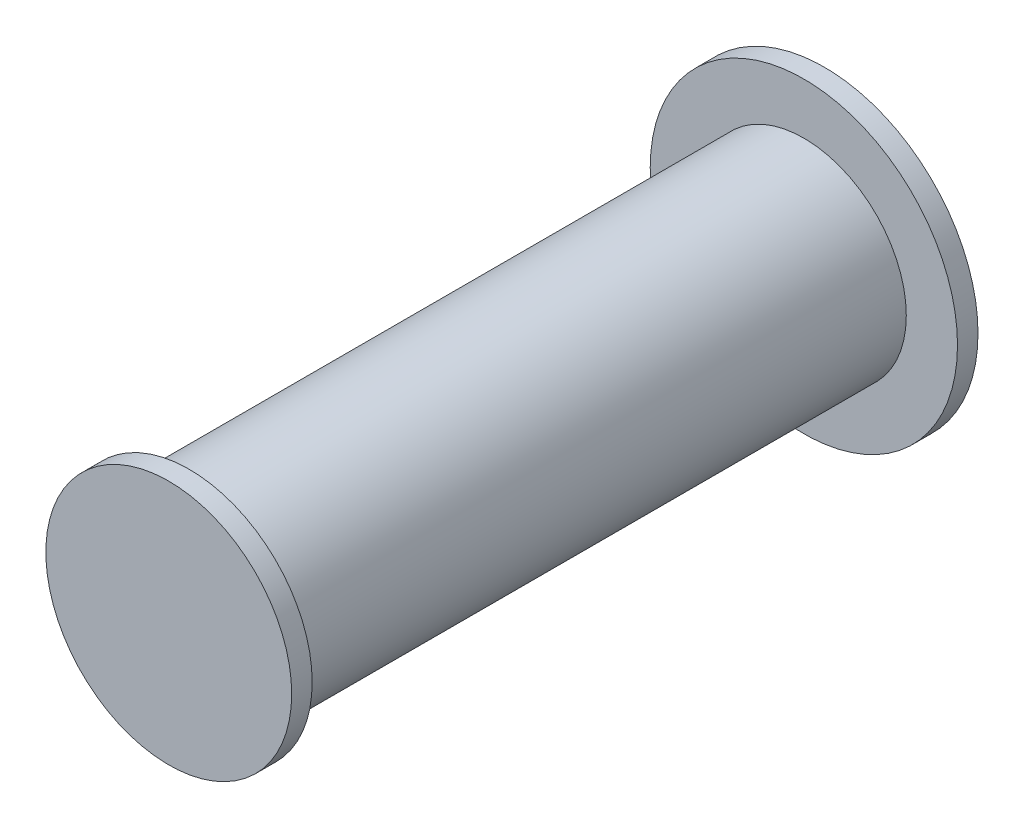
ISO-10303-21;
HEADER;
FILE_DESCRIPTION(('STEP AP214'),'2;1');
FILE_NAME('part.step','',(''),(''),'','','');
FILE_SCHEMA(('AUTOMOTIVE_DESIGN { 1 0 10303 214 1 1 1 1 }'));
ENDSEC;
DATA;
#1=APPLICATION_CONTEXT('core data for automotive mechanical design processes');
#2=APPLICATION_PROTOCOL_DEFINITION('international standard','automotive_design',2000,#1);
#3=PRODUCT_CONTEXT('',#1,'mechanical');
#4=PRODUCT('Part','Part','',(#3));
#5=PRODUCT_RELATED_PRODUCT_CATEGORY('part','',(#4));
#6=PRODUCT_DEFINITION_FORMATION('','',#4);
#7=PRODUCT_DEFINITION_CONTEXT('part definition',#1,'design');
#8=PRODUCT_DEFINITION('design','',#6,#7);
#9=PRODUCT_DEFINITION_SHAPE('','',#8);
#10=(LENGTH_UNIT() NAMED_UNIT(*) SI_UNIT(.MILLI.,.METRE.));
#11=(NAMED_UNIT(*) PLANE_ANGLE_UNIT() SI_UNIT($,.RADIAN.));
#12=(NAMED_UNIT(*) SI_UNIT($,.STERADIAN.) SOLID_ANGLE_UNIT());
#13=UNCERTAINTY_MEASURE_WITH_UNIT(LENGTH_MEASURE(1.E-05),#10,'distance_accuracy_value','');
#14=(GEOMETRIC_REPRESENTATION_CONTEXT(3) GLOBAL_UNCERTAINTY_ASSIGNED_CONTEXT((#13)) GLOBAL_UNIT_ASSIGNED_CONTEXT((#10,
#11,#12)) REPRESENTATION_CONTEXT('',''));
#15=CARTESIAN_POINT('',(0.,0.,0.));
#16=DIRECTION('',(0.,0.,1.));
#17=DIRECTION('',(1.,0.,0.));
#18=AXIS2_PLACEMENT_3D('',#15,#16,#17);
#19=CARTESIAN_POINT('',(0.,0.,10.));
#20=DIRECTION('',(0.,0.,1.));
#21=DIRECTION('',(1.,0.,0.));
#22=AXIS2_PLACEMENT_3D('',#19,#20,#21);
#23=PLANE('',#22);
#24=CARTESIAN_POINT('',(0.,0.,10.));
#25=DIRECTION('',(0.,0.,1.));
#26=DIRECTION('',(1.,0.,0.));
#27=AXIS2_PLACEMENT_3D('',#24,#25,#26);
#28=CIRCLE('',#27,75.);
#29=CARTESIAN_POINT('',(75.,0.,10.));
#30=VERTEX_POINT('',#29);
#31=EDGE_CURVE('E10',#30,#30,#28,.T.);
#32=ORIENTED_EDGE('',*,*,#31,.T.);
#33=EDGE_LOOP('',(#32));
#34=FACE_BOUND('',#33,.T.);
#35=CARTESIAN_POINT('',(0.,0.,10.));
#36=DIRECTION('',(0.,0.,1.));
#37=DIRECTION('',(1.,0.,0.));
#38=AXIS2_PLACEMENT_3D('',#35,#36,#37);
#39=CIRCLE('',#38,50.);
#40=CARTESIAN_POINT('',(50.,0.,10.));
#41=VERTEX_POINT('',#40);
#42=EDGE_CURVE('E44',#41,#41,#39,.T.);
#43=ORIENTED_EDGE('',*,*,#42,.F.);
#44=EDGE_LOOP('',(#43));
#45=FACE_BOUND('',#44,.T.);
#46=ADVANCED_FACE('F31',(#34,#45),#23,.T.);
#47=CARTESIAN_POINT('',(0.,0.,10.));
#48=DIRECTION('',(0.,0.,-1.));
#49=DIRECTION('',(-1.,0.,0.));
#50=AXIS2_PLACEMENT_3D('',#47,#48,#49);
#51=CYLINDRICAL_SURFACE('',#50,75.);
#52=ORIENTED_EDGE('',*,*,#31,.F.);
#53=EDGE_LOOP('',(#52));
#54=FACE_BOUND('',#53,.T.);
#55=CARTESIAN_POINT('',(0.,0.,0.));
#56=DIRECTION('',(0.,0.,1.));
#57=DIRECTION('',(1.,0.,0.));
#58=AXIS2_PLACEMENT_3D('',#55,#56,#57);
#59=CIRCLE('',#58,75.);
#60=CARTESIAN_POINT('',(75.,0.,0.));
#61=VERTEX_POINT('',#60);
#62=EDGE_CURVE('E35',#61,#61,#59,.T.);
#63=ORIENTED_EDGE('',*,*,#62,.T.);
#64=EDGE_LOOP('',(#63));
#65=FACE_BOUND('',#64,.T.);
#66=ADVANCED_FACE('F33',(#54,#65),#51,.T.);
#67=CARTESIAN_POINT('',(0.,0.,0.));
#68=DIRECTION('',(0.,0.,1.));
#69=DIRECTION('',(1.,0.,0.));
#70=AXIS2_PLACEMENT_3D('',#67,#68,#69);
#71=PLANE('',#70);
#72=ORIENTED_EDGE('',*,*,#62,.F.);
#73=EDGE_LOOP('',(#72));
#74=FACE_BOUND('',#73,.T.);
#75=ADVANCED_FACE('F73',(#74),#71,.F.);
#76=CARTESIAN_POINT('',(0.,0.,310.));
#77=DIRECTION('',(0.,0.,-1.));
#78=DIRECTION('',(-1.,0.,0.));
#79=AXIS2_PLACEMENT_3D('',#76,#77,#78);
#80=CYLINDRICAL_SURFACE('',#79,50.);
#81=CARTESIAN_POINT('',(0.,0.,310.));
#82=DIRECTION('',(0.,0.,1.));
#83=DIRECTION('',(1.,0.,0.));
#84=AXIS2_PLACEMENT_3D('',#81,#82,#83);
#85=CIRCLE('',#84,50.);
#86=CARTESIAN_POINT('',(50.,0.,310.));
#87=VERTEX_POINT('',#86);
#88=EDGE_CURVE('E42',#87,#87,#85,.T.);
#89=ORIENTED_EDGE('',*,*,#88,.F.);
#90=EDGE_LOOP('',(#89));
#91=FACE_BOUND('',#90,.T.);
#92=ORIENTED_EDGE('',*,*,#42,.T.);
#93=EDGE_LOOP('',(#92));
#94=FACE_BOUND('',#93,.T.);
#95=ADVANCED_FACE('F67',(#91,#94),#80,.T.);
#96=CARTESIAN_POINT('',(0.,0.,310.));
#97=DIRECTION('',(0.,0.,1.));
#98=DIRECTION('',(1.,0.,0.));
#99=AXIS2_PLACEMENT_3D('',#96,#97,#98);
#100=PLANE('',#99);
#101=CARTESIAN_POINT('',(0.,0.,310.));
#102=DIRECTION('',(0.,0.,1.));
#103=DIRECTION('',(1.,0.,0.));
#104=AXIS2_PLACEMENT_3D('',#101,#102,#103);
#105=CIRCLE('',#104,60.);
#106=CARTESIAN_POINT('',(60.,0.,310.));
#107=VERTEX_POINT('',#106);
#108=EDGE_CURVE('E50',#107,#107,#105,.T.);
#109=ORIENTED_EDGE('',*,*,#108,.F.);
#110=EDGE_LOOP('',(#109));
#111=FACE_BOUND('',#110,.T.);
#112=ORIENTED_EDGE('',*,*,#88,.T.);
#113=EDGE_LOOP('',(#112));
#114=FACE_BOUND('',#113,.T.);
#115=ADVANCED_FACE('F61',(#111,#114),#100,.F.);
#116=CARTESIAN_POINT('',(0.,0.,320.));
#117=DIRECTION('',(0.,0.,-1.));
#118=DIRECTION('',(-1.,0.,0.));
#119=AXIS2_PLACEMENT_3D('',#116,#117,#118);
#120=CYLINDRICAL_SURFACE('',#119,60.);
#121=CARTESIAN_POINT('',(0.,0.,320.));
#122=DIRECTION('',(0.,0.,1.));
#123=DIRECTION('',(1.,0.,0.));
#124=AXIS2_PLACEMENT_3D('',#121,#122,#123);
#125=CIRCLE('',#124,60.);
#126=CARTESIAN_POINT('',(60.,0.,320.));
#127=VERTEX_POINT('',#126);
#128=EDGE_CURVE('E47',#127,#127,#125,.T.);
#129=ORIENTED_EDGE('',*,*,#128,.F.);
#130=EDGE_LOOP('',(#129));
#131=FACE_BOUND('',#130,.T.);
#132=ORIENTED_EDGE('',*,*,#108,.T.);
#133=EDGE_LOOP('',(#132));
#134=FACE_BOUND('',#133,.T.);
#135=ADVANCED_FACE('F58',(#131,#134),#120,.T.);
#136=CARTESIAN_POINT('',(0.,0.,320.));
#137=DIRECTION('',(0.,0.,1.));
#138=DIRECTION('',(1.,0.,0.));
#139=AXIS2_PLACEMENT_3D('',#136,#137,#138);
#140=PLANE('',#139);
#141=ORIENTED_EDGE('',*,*,#128,.T.);
#142=EDGE_LOOP('',(#141));
#143=FACE_BOUND('',#142,.T.);
#144=ADVANCED_FACE('F56',(#143),#140,.T.);
#145=CLOSED_SHELL('',(#46,#66,#75,#95,#115,#135,#144));
#146=MANIFOLD_SOLID_BREP('B2',#145);
#147=ADVANCED_BREP_SHAPE_REPRESENTATION('',(#18,#146),#14);
#148=SHAPE_DEFINITION_REPRESENTATION(#9,#147);
ENDSEC;
END-ISO-10303-21;
